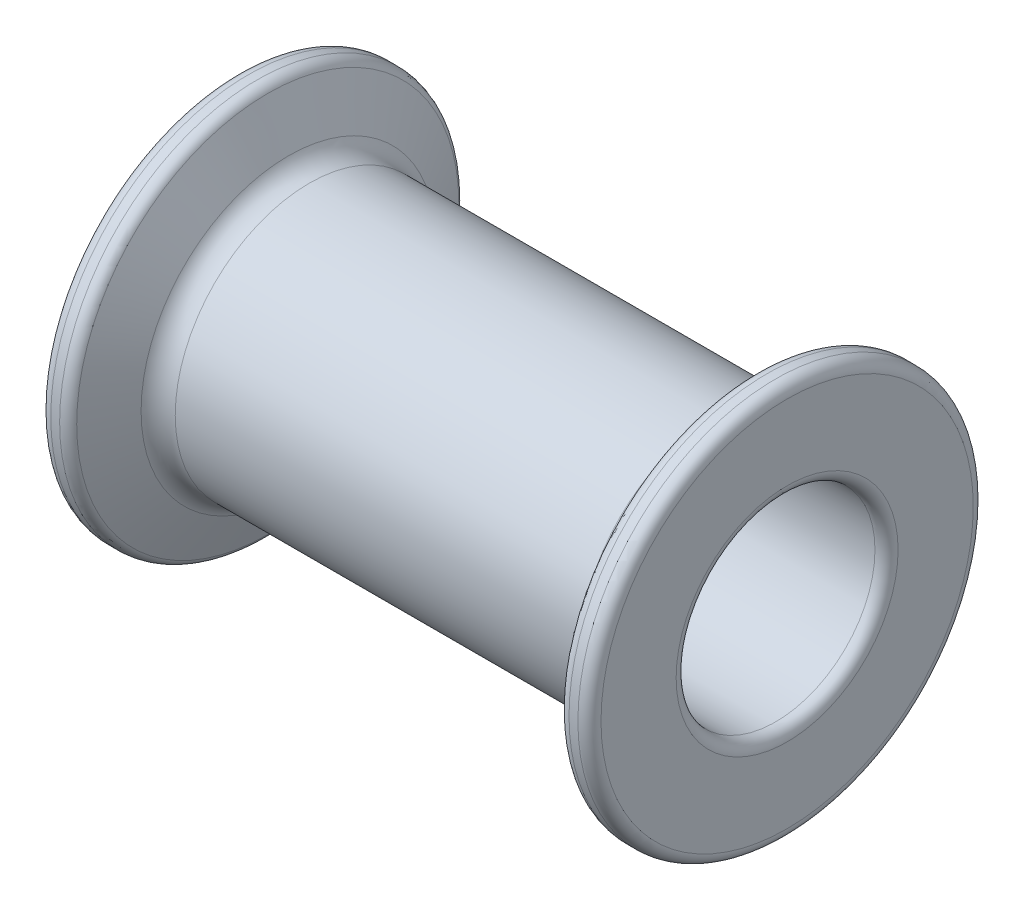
ISO-10303-21;
HEADER;
FILE_DESCRIPTION(('STEP AP214'),'2;1');
FILE_NAME('part.step','',(''),(''),'','','');
FILE_SCHEMA(('AUTOMOTIVE_DESIGN { 1 0 10303 214 1 1 1 1 }'));
ENDSEC;
DATA;
#1=APPLICATION_CONTEXT('core data for automotive mechanical design processes');
#2=APPLICATION_PROTOCOL_DEFINITION('international standard','automotive_design',2000,#1);
#3=PRODUCT_CONTEXT('',#1,'mechanical');
#4=PRODUCT('Part','Part','',(#3));
#5=PRODUCT_RELATED_PRODUCT_CATEGORY('part','',(#4));
#6=PRODUCT_DEFINITION_FORMATION('','',#4);
#7=PRODUCT_DEFINITION_CONTEXT('part definition',#1,'design');
#8=PRODUCT_DEFINITION('design','',#6,#7);
#9=PRODUCT_DEFINITION_SHAPE('','',#8);
#10=(LENGTH_UNIT() NAMED_UNIT(*) SI_UNIT(.MILLI.,.METRE.));
#11=(NAMED_UNIT(*) PLANE_ANGLE_UNIT() SI_UNIT($,.RADIAN.));
#12=(NAMED_UNIT(*) SI_UNIT($,.STERADIAN.) SOLID_ANGLE_UNIT());
#13=UNCERTAINTY_MEASURE_WITH_UNIT(LENGTH_MEASURE(1.E-05),#10,'distance_accuracy_value','');
#14=(GEOMETRIC_REPRESENTATION_CONTEXT(3) GLOBAL_UNCERTAINTY_ASSIGNED_CONTEXT((#13)) GLOBAL_UNIT_ASSIGNED_CONTEXT((#10,
#11,#12)) REPRESENTATION_CONTEXT('',''));
#15=CARTESIAN_POINT('',(0.,0.,0.));
#16=DIRECTION('',(0.,0.,1.));
#17=DIRECTION('',(1.,0.,0.));
#18=AXIS2_PLACEMENT_3D('',#15,#16,#17);
#19=CARTESIAN_POINT('',(0.,0.,0.));
#20=DIRECTION('',(1.,0.,0.));
#21=DIRECTION('',(0.,0.,-1.));
#22=AXIS2_PLACEMENT_3D('',#19,#20,#21);
#23=CYLINDRICAL_SURFACE('',#22,4.3);
#24=CARTESIAN_POINT('',(-11.4,0.,0.));
#25=DIRECTION('',(-1.,0.,0.));
#26=DIRECTION('',(0.,0.,1.));
#27=AXIS2_PLACEMENT_3D('',#24,#25,#26);
#28=CIRCLE('',#27,4.3);
#29=CARTESIAN_POINT('',(-11.4,0.,4.3));
#30=VERTEX_POINT('',#29);
#31=EDGE_CURVE('E245',#30,#30,#28,.F.);
#32=ORIENTED_EDGE('',*,*,#31,.F.);
#33=EDGE_LOOP('',(#32));
#34=FACE_BOUND('',#33,.T.);
#35=CARTESIAN_POINT('',(11.4,0.,0.));
#36=DIRECTION('',(1.,0.,0.));
#37=DIRECTION('',(0.,0.,-1.));
#38=AXIS2_PLACEMENT_3D('',#35,#36,#37);
#39=CIRCLE('',#38,4.3);
#40=CARTESIAN_POINT('',(11.4,0.,-4.3));
#41=VERTEX_POINT('',#40);
#42=EDGE_CURVE('E68',#41,#41,#39,.F.);
#43=ORIENTED_EDGE('',*,*,#42,.F.);
#44=EDGE_LOOP('',(#43));
#45=FACE_BOUND('',#44,.T.);
#46=ADVANCED_FACE('F17',(#34,#45),#23,.F.);
#47=CARTESIAN_POINT('',(-11.4,0.,0.));
#48=DIRECTION('',(-1.,0.,0.));
#49=DIRECTION('',(0.,0.,1.));
#50=AXIS2_PLACEMENT_3D('',#47,#48,#49);
#51=TOROIDAL_SURFACE('',#50,4.8,0.5);
#52=ORIENTED_EDGE('',*,*,#31,.T.);
#53=EDGE_LOOP('',(#52));
#54=FACE_BOUND('',#53,.T.);
#55=CARTESIAN_POINT('',(-11.9,0.,0.));
#56=DIRECTION('',(-1.,0.,0.));
#57=DIRECTION('',(0.,0.,1.));
#58=AXIS2_PLACEMENT_3D('',#55,#56,#57);
#59=CIRCLE('',#58,4.8);
#60=CARTESIAN_POINT('',(-11.9,0.,-4.8));
#61=VERTEX_POINT('',#60);
#62=CARTESIAN_POINT('',(-11.9,0.,4.8));
#63=VERTEX_POINT('',#62);
#64=EDGE_CURVE('E58',#61,#63,#59,.F.);
#65=ORIENTED_EDGE('',*,*,#64,.F.);
#66=CARTESIAN_POINT('',(-11.9,0.,0.));
#67=DIRECTION('',(-1.,0.,0.));
#68=DIRECTION('',(0.,0.,-1.));
#69=AXIS2_PLACEMENT_3D('',#66,#67,#68);
#70=CIRCLE('',#69,4.8);
#71=EDGE_CURVE('E56',#63,#61,#70,.F.);
#72=ORIENTED_EDGE('',*,*,#71,.F.);
#73=EDGE_LOOP('',(#65,#72));
#74=FACE_BOUND('',#73,.T.);
#75=ADVANCED_FACE('F60',(#54,#74),#51,.T.);
#76=CARTESIAN_POINT('',(11.4,0.,0.));
#77=DIRECTION('',(1.,0.,0.));
#78=DIRECTION('',(0.,0.,-1.));
#79=AXIS2_PLACEMENT_3D('',#76,#77,#78);
#80=TOROIDAL_SURFACE('',#79,4.8,0.5);
#81=ORIENTED_EDGE('',*,*,#42,.T.);
#82=EDGE_LOOP('',(#81));
#83=FACE_BOUND('',#82,.T.);
#84=CARTESIAN_POINT('',(11.9,0.,0.));
#85=DIRECTION('',(1.,0.,0.));
#86=DIRECTION('',(0.,0.,-1.));
#87=AXIS2_PLACEMENT_3D('',#84,#85,#86);
#88=CIRCLE('',#87,4.8);
#89=CARTESIAN_POINT('',(11.9,0.,4.8));
#90=VERTEX_POINT('',#89);
#91=CARTESIAN_POINT('',(11.9,0.,-4.8));
#92=VERTEX_POINT('',#91);
#93=EDGE_CURVE('E159',#90,#92,#88,.F.);
#94=ORIENTED_EDGE('',*,*,#93,.F.);
#95=CARTESIAN_POINT('',(11.9,0.,0.));
#96=DIRECTION('',(1.,0.,0.));
#97=DIRECTION('',(0.,0.,1.));
#98=AXIS2_PLACEMENT_3D('',#95,#96,#97);
#99=CIRCLE('',#98,4.8);
#100=EDGE_CURVE('E63',#92,#90,#99,.F.);
#101=ORIENTED_EDGE('',*,*,#100,.F.);
#102=EDGE_LOOP('',(#94,#101));
#103=FACE_BOUND('',#102,.T.);
#104=ADVANCED_FACE('F87',(#83,#103),#80,.T.);
#105=CARTESIAN_POINT('',(-11.9,8.55,0.));
#106=DIRECTION('',(-1.,0.,0.));
#107=DIRECTION('',(0.,0.,1.));
#108=AXIS2_PLACEMENT_3D('',#105,#106,#107);
#109=PLANE('',#108);
#110=CARTESIAN_POINT('',(-11.9,0.,0.));
#111=DIRECTION('',(1.,0.,0.));
#112=DIRECTION('',(0.,0.,-1.));
#113=AXIS2_PLACEMENT_3D('',#110,#111,#112);
#114=CIRCLE('',#113,8.05);
#115=CARTESIAN_POINT('',(-11.9,0.,-8.05));
#116=VERTEX_POINT('',#115);
#117=CARTESIAN_POINT('',(-11.9,0.,8.05));
#118=VERTEX_POINT('',#117);
#119=EDGE_CURVE('E122',#116,#118,#114,.T.);
#120=ORIENTED_EDGE('',*,*,#119,.F.);
#121=CARTESIAN_POINT('',(-11.9,0.,0.));
#122=DIRECTION('',(1.,0.,0.));
#123=DIRECTION('',(0.,0.,1.));
#124=AXIS2_PLACEMENT_3D('',#121,#122,#123);
#125=CIRCLE('',#124,8.05);
#126=EDGE_CURVE('E110',#118,#116,#125,.T.);
#127=ORIENTED_EDGE('',*,*,#126,.F.);
#128=EDGE_LOOP('',(#120,#127));
#129=FACE_BOUND('',#128,.T.);
#130=ORIENTED_EDGE('',*,*,#71,.T.);
#131=ORIENTED_EDGE('',*,*,#64,.T.);
#132=EDGE_LOOP('',(#130,#131));
#133=FACE_BOUND('',#132,.T.);
#134=ADVANCED_FACE('F67',(#129,#133),#109,.T.);
#135=CARTESIAN_POINT('',(11.9,8.55,0.));
#136=DIRECTION('',(1.,0.,0.));
#137=DIRECTION('',(0.,0.,-1.));
#138=AXIS2_PLACEMENT_3D('',#135,#136,#137);
#139=PLANE('',#138);
#140=CARTESIAN_POINT('',(11.9,0.,0.));
#141=DIRECTION('',(-1.,0.,0.));
#142=DIRECTION('',(0.,0.,1.));
#143=AXIS2_PLACEMENT_3D('',#140,#141,#142);
#144=CIRCLE('',#143,8.05);
#145=CARTESIAN_POINT('',(11.9,0.,8.05));
#146=VERTEX_POINT('',#145);
#147=CARTESIAN_POINT('',(11.9,0.,-8.05));
#148=VERTEX_POINT('',#147);
#149=EDGE_CURVE('E169',#146,#148,#144,.T.);
#150=ORIENTED_EDGE('',*,*,#149,.F.);
#151=CARTESIAN_POINT('',(11.9,0.,0.));
#152=DIRECTION('',(-1.,0.,0.));
#153=DIRECTION('',(0.,0.,-1.));
#154=AXIS2_PLACEMENT_3D('',#151,#152,#153);
#155=CIRCLE('',#154,8.05);
#156=EDGE_CURVE('E35',#148,#146,#155,.T.);
#157=ORIENTED_EDGE('',*,*,#156,.F.);
#158=EDGE_LOOP('',(#150,#157));
#159=FACE_BOUND('',#158,.T.);
#160=ORIENTED_EDGE('',*,*,#100,.T.);
#161=ORIENTED_EDGE('',*,*,#93,.T.);
#162=EDGE_LOOP('',(#160,#161));
#163=FACE_BOUND('',#162,.T.);
#164=ADVANCED_FACE('F86',(#159,#163),#139,.T.);
#165=CARTESIAN_POINT('',(-11.4,0.,0.));
#166=DIRECTION('',(-1.,0.,0.));
#167=DIRECTION('',(0.,0.,1.));
#168=AXIS2_PLACEMENT_3D('',#165,#166,#167);
#169=TOROIDAL_SURFACE('',#168,8.05,0.5);
#170=ORIENTED_EDGE('',*,*,#126,.T.);
#171=ORIENTED_EDGE('',*,*,#119,.T.);
#172=EDGE_LOOP('',(#170,#171));
#173=FACE_BOUND('',#172,.T.);
#174=CARTESIAN_POINT('',(-11.4,0.,0.));
#175=DIRECTION('',(1.,0.,0.));
#176=DIRECTION('',(0.,0.,-1.));
#177=AXIS2_PLACEMENT_3D('',#174,#175,#176);
#178=CIRCLE('',#177,8.55);
#179=CARTESIAN_POINT('',(-11.4,0.,-8.55));
#180=VERTEX_POINT('',#179);
#181=EDGE_CURVE('E126',#180,#180,#178,.T.);
#182=ORIENTED_EDGE('',*,*,#181,.F.);
#183=EDGE_LOOP('',(#182));
#184=FACE_BOUND('',#183,.T.);
#185=ADVANCED_FACE('F127',(#173,#184),#169,.T.);
#186=CARTESIAN_POINT('',(11.4,0.,0.));
#187=DIRECTION('',(1.,0.,0.));
#188=DIRECTION('',(0.,0.,-1.));
#189=AXIS2_PLACEMENT_3D('',#186,#187,#188);
#190=TOROIDAL_SURFACE('',#189,8.05,0.5);
#191=ORIENTED_EDGE('',*,*,#156,.T.);
#192=ORIENTED_EDGE('',*,*,#149,.T.);
#193=EDGE_LOOP('',(#191,#192));
#194=FACE_BOUND('',#193,.T.);
#195=CARTESIAN_POINT('',(11.4,0.,0.));
#196=DIRECTION('',(-1.,0.,0.));
#197=DIRECTION('',(0.,0.,1.));
#198=AXIS2_PLACEMENT_3D('',#195,#196,#197);
#199=CIRCLE('',#198,8.55);
#200=CARTESIAN_POINT('',(11.4,0.,8.55));
#201=VERTEX_POINT('',#200);
#202=EDGE_CURVE('E71',#201,#201,#199,.T.);
#203=ORIENTED_EDGE('',*,*,#202,.F.);
#204=EDGE_LOOP('',(#203));
#205=FACE_BOUND('',#204,.T.);
#206=ADVANCED_FACE('F137',(#194,#205),#190,.T.);
#207=CARTESIAN_POINT('',(0.,0.,0.));
#208=DIRECTION('',(1.,0.,0.));
#209=DIRECTION('',(0.,0.,-1.));
#210=AXIS2_PLACEMENT_3D('',#207,#208,#209);
#211=CYLINDRICAL_SURFACE('',#210,8.55);
#212=CARTESIAN_POINT('',(-11.0166894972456,0.,0.));
#213=DIRECTION('',(-1.,0.,0.));
#214=DIRECTION('',(0.,0.,1.));
#215=AXIS2_PLACEMENT_3D('',#212,#213,#214);
#216=CIRCLE('',#215,8.55);
#217=CARTESIAN_POINT('',(-11.0166894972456,0.,8.55));
#218=VERTEX_POINT('',#217);
#219=EDGE_CURVE('E306',#218,#218,#216,.F.);
#220=ORIENTED_EDGE('',*,*,#219,.F.);
#221=EDGE_LOOP('',(#220));
#222=FACE_BOUND('',#221,.T.);
#223=ORIENTED_EDGE('',*,*,#181,.T.);
#224=EDGE_LOOP('',(#223));
#225=FACE_BOUND('',#224,.T.);
#226=ADVANCED_FACE('F315',(#222,#225),#211,.T.);
#227=CARTESIAN_POINT('',(0.,0.,0.));
#228=DIRECTION('',(-1.,0.,0.));
#229=DIRECTION('',(0.,0.,1.));
#230=AXIS2_PLACEMENT_3D('',#227,#228,#229);
#231=CYLINDRICAL_SURFACE('',#230,8.55);
#232=ORIENTED_EDGE('',*,*,#202,.T.);
#233=EDGE_LOOP('',(#232));
#234=FACE_BOUND('',#233,.T.);
#235=CARTESIAN_POINT('',(11.0166894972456,0.,0.));
#236=DIRECTION('',(-1.,0.,0.));
#237=DIRECTION('',(0.,0.,1.));
#238=AXIS2_PLACEMENT_3D('',#235,#236,#237);
#239=CIRCLE('',#238,8.55);
#240=CARTESIAN_POINT('',(11.0166894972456,0.,8.55));
#241=VERTEX_POINT('',#240);
#242=EDGE_CURVE('E289',#241,#241,#239,.T.);
#243=ORIENTED_EDGE('',*,*,#242,.F.);
#244=EDGE_LOOP('',(#243));
#245=FACE_BOUND('',#244,.T.);
#246=ADVANCED_FACE('F303',(#234,#245),#231,.T.);
#247=CARTESIAN_POINT('',(-11.0166894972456,0.,0.));
#248=DIRECTION('',(-1.,0.,0.));
#249=DIRECTION('',(0.,0.,1.));
#250=AXIS2_PLACEMENT_3D('',#247,#248,#249);
#251=TOROIDAL_SURFACE('',#250,8.05,0.5);
#252=ORIENTED_EDGE('',*,*,#219,.T.);
#253=EDGE_LOOP('',(#252));
#254=FACE_BOUND('',#253,.T.);
#255=CARTESIAN_POINT('',(-10.5646533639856,0.,0.));
#256=DIRECTION('',(-1.,0.,0.));
#257=DIRECTION('',(0.,0.,1.));
#258=AXIS2_PLACEMENT_3D('',#255,#256,#257);
#259=CIRCLE('',#258,8.26368980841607);
#260=CARTESIAN_POINT('',(-10.5646533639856,0.,8.26368980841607));
#261=VERTEX_POINT('',#260);
#262=EDGE_CURVE('E286',#261,#261,#259,.F.);
#263=ORIENTED_EDGE('',*,*,#262,.F.);
#264=EDGE_LOOP('',(#263));
#265=FACE_BOUND('',#264,.T.);
#266=ADVANCED_FACE('F299',(#254,#265),#251,.T.);
#267=CARTESIAN_POINT('',(11.0166894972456,0.,0.));
#268=DIRECTION('',(-1.,0.,0.));
#269=DIRECTION('',(0.,0.,1.));
#270=AXIS2_PLACEMENT_3D('',#267,#268,#269);
#271=TOROIDAL_SURFACE('',#270,8.05,0.5);
#272=CARTESIAN_POINT('',(10.5646533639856,0.,0.));
#273=DIRECTION('',(1.,0.,0.));
#274=DIRECTION('',(0.,0.,1.));
#275=AXIS2_PLACEMENT_3D('',#272,#273,#274);
#276=CIRCLE('',#275,8.26368980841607);
#277=CARTESIAN_POINT('',(10.5646533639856,0.,8.26368980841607));
#278=VERTEX_POINT('',#277);
#279=EDGE_CURVE('E283',#278,#278,#276,.F.);
#280=ORIENTED_EDGE('',*,*,#279,.F.);
#281=EDGE_LOOP('',(#280));
#282=FACE_BOUND('',#281,.T.);
#283=ORIENTED_EDGE('',*,*,#242,.T.);
#284=EDGE_LOOP('',(#283));
#285=FACE_BOUND('',#284,.T.);
#286=ADVANCED_FACE('F294',(#282,#285),#271,.T.);
#287=CARTESIAN_POINT('',(-10.5646533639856,0.,0.));
#288=DIRECTION('',(-1.,0.,0.));
#289=DIRECTION('',(0.,0.,1.));
#290=AXIS2_PLACEMENT_3D('',#287,#288,#289);
#291=CONICAL_SURFACE('',#290,8.26368980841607,1.12920396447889);
#292=ORIENTED_EDGE('',*,*,#262,.T.);
#293=EDGE_LOOP('',(#292));
#294=FACE_BOUND('',#293,.T.);
#295=CARTESIAN_POINT('',(-9.67069327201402,0.,0.));
#296=DIRECTION('',(1.,0.,0.));
#297=DIRECTION('',(0.,0.,-1.));
#298=AXIS2_PLACEMENT_3D('',#295,#296,#297);
#299=CIRCLE('',#298,6.37262038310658);
#300=CARTESIAN_POINT('',(-9.67069327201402,0.,-6.37262038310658));
#301=VERTEX_POINT('',#300);
#302=EDGE_CURVE('E278',#301,#301,#299,.F.);
#303=ORIENTED_EDGE('',*,*,#302,.T.);
#304=EDGE_LOOP('',(#303));
#305=FACE_BOUND('',#304,.T.);
#306=ADVANCED_FACE('F298',(#294,#305),#291,.T.);
#307=CARTESIAN_POINT('',(10.5646533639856,0.,0.));
#308=DIRECTION('',(1.,0.,0.));
#309=DIRECTION('',(0.,0.,-1.));
#310=AXIS2_PLACEMENT_3D('',#307,#308,#309);
#311=CONICAL_SURFACE('',#310,8.26368980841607,1.12920396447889);
#312=CARTESIAN_POINT('',(9.67069327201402,0.,0.));
#313=DIRECTION('',(1.,0.,0.));
#314=DIRECTION('',(0.,0.,-1.));
#315=AXIS2_PLACEMENT_3D('',#312,#313,#314);
#316=CIRCLE('',#315,6.37262038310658);
#317=CARTESIAN_POINT('',(9.67069327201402,0.,-6.37262038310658));
#318=VERTEX_POINT('',#317);
#319=EDGE_CURVE('E276',#318,#318,#316,.T.);
#320=ORIENTED_EDGE('',*,*,#319,.T.);
#321=EDGE_LOOP('',(#320));
#322=FACE_BOUND('',#321,.T.);
#323=ORIENTED_EDGE('',*,*,#279,.T.);
#324=EDGE_LOOP('',(#323));
#325=FACE_BOUND('',#324,.T.);
#326=ADVANCED_FACE('F343',(#322,#325),#311,.T.);
#327=CARTESIAN_POINT('',(-8.76662100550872,0.,0.));
#328=DIRECTION('',(1.,0.,0.));
#329=DIRECTION('',(0.,0.,-1.));
#330=AXIS2_PLACEMENT_3D('',#327,#328,#329);
#331=TOROIDAL_SURFACE('',#330,6.8,1.);
#332=CARTESIAN_POINT('',(-8.76662100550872,0.,0.));
#333=DIRECTION('',(1.,0.,0.));
#334=DIRECTION('',(0.,0.,-1.));
#335=AXIS2_PLACEMENT_3D('',#332,#333,#334);
#336=CIRCLE('',#335,5.8);
#337=CARTESIAN_POINT('',(-8.76662100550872,0.,-5.8));
#338=VERTEX_POINT('',#337);
#339=EDGE_CURVE('E27',#338,#338,#336,.T.);
#340=ORIENTED_EDGE('',*,*,#339,.F.);
#341=EDGE_LOOP('',(#340));
#342=FACE_BOUND('',#341,.T.);
#343=ORIENTED_EDGE('',*,*,#302,.F.);
#344=EDGE_LOOP('',(#343));
#345=FACE_BOUND('',#344,.T.);
#346=ADVANCED_FACE('F265',(#342,#345),#331,.F.);
#347=CARTESIAN_POINT('',(8.76662100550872,0.,0.));
#348=DIRECTION('',(1.,0.,0.));
#349=DIRECTION('',(0.,0.,-1.));
#350=AXIS2_PLACEMENT_3D('',#347,#348,#349);
#351=TOROIDAL_SURFACE('',#350,6.8,1.);
#352=ORIENTED_EDGE('',*,*,#319,.F.);
#353=EDGE_LOOP('',(#352));
#354=FACE_BOUND('',#353,.T.);
#355=CARTESIAN_POINT('',(8.76662100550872,0.,0.));
#356=DIRECTION('',(1.,0.,0.));
#357=DIRECTION('',(0.,0.,-1.));
#358=AXIS2_PLACEMENT_3D('',#355,#356,#357);
#359=CIRCLE('',#358,5.8);
#360=CARTESIAN_POINT('',(8.76662100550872,0.,-5.8));
#361=VERTEX_POINT('',#360);
#362=EDGE_CURVE('E11',#361,#361,#359,.F.);
#363=ORIENTED_EDGE('',*,*,#362,.F.);
#364=EDGE_LOOP('',(#363));
#365=FACE_BOUND('',#364,.T.);
#366=ADVANCED_FACE('F259',(#354,#365),#351,.F.);
#367=CARTESIAN_POINT('',(0.,0.,0.));
#368=DIRECTION('',(1.,0.,0.));
#369=DIRECTION('',(0.,0.,-1.));
#370=AXIS2_PLACEMENT_3D('',#367,#368,#369);
#371=CYLINDRICAL_SURFACE('',#370,5.8);
#372=ORIENTED_EDGE('',*,*,#362,.T.);
#373=EDGE_LOOP('',(#372));
#374=FACE_BOUND('',#373,.T.);
#375=ORIENTED_EDGE('',*,*,#339,.T.);
#376=EDGE_LOOP('',(#375));
#377=FACE_BOUND('',#376,.T.);
#378=ADVANCED_FACE('F257',(#374,#377),#371,.T.);
#379=CLOSED_SHELL('',(#46,#75,#104,#134,#164,#185,#206,#226,#246,#266,#286,#306,#326,#346,#366,#378));
#380=MANIFOLD_SOLID_BREP('B1',#379);
#381=ADVANCED_BREP_SHAPE_REPRESENTATION('',(#18,#380),#14);
#382=SHAPE_DEFINITION_REPRESENTATION(#9,#381);
ENDSEC;
END-ISO-10303-21;
